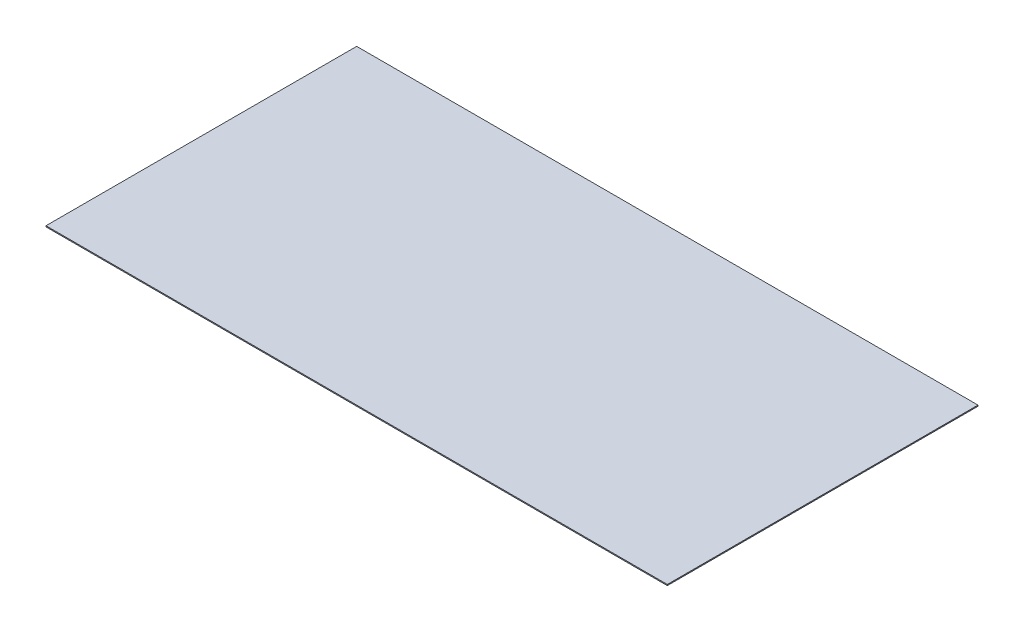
ISO-10303-21;
HEADER;
FILE_DESCRIPTION(('STEP AP214'),'2;1');
FILE_NAME('part.step','',(''),(''),'','','');
FILE_SCHEMA(('AUTOMOTIVE_DESIGN { 1 0 10303 214 1 1 1 1 }'));
ENDSEC;
DATA;
#1=APPLICATION_CONTEXT('core data for automotive mechanical design processes');
#2=APPLICATION_PROTOCOL_DEFINITION('international standard','automotive_design',2000,#1);
#3=PRODUCT_CONTEXT('',#1,'mechanical');
#4=PRODUCT('Part','Part','',(#3));
#5=PRODUCT_RELATED_PRODUCT_CATEGORY('part','',(#4));
#6=PRODUCT_DEFINITION_FORMATION('','',#4);
#7=PRODUCT_DEFINITION_CONTEXT('part definition',#1,'design');
#8=PRODUCT_DEFINITION('design','',#6,#7);
#9=PRODUCT_DEFINITION_SHAPE('','',#8);
#10=(LENGTH_UNIT() NAMED_UNIT(*) SI_UNIT(.MILLI.,.METRE.));
#11=(NAMED_UNIT(*) PLANE_ANGLE_UNIT() SI_UNIT($,.RADIAN.));
#12=(NAMED_UNIT(*) SI_UNIT($,.STERADIAN.) SOLID_ANGLE_UNIT());
#13=UNCERTAINTY_MEASURE_WITH_UNIT(LENGTH_MEASURE(1.E-05),#10,'distance_accuracy_value','');
#14=(GEOMETRIC_REPRESENTATION_CONTEXT(3) GLOBAL_UNCERTAINTY_ASSIGNED_CONTEXT((#13)) GLOBAL_UNIT_ASSIGNED_CONTEXT((#10,
#11,#12)) REPRESENTATION_CONTEXT('',''));
#15=CARTESIAN_POINT('',(0.,0.,0.));
#16=DIRECTION('',(0.,0.,1.));
#17=DIRECTION('',(1.,0.,0.));
#18=AXIS2_PLACEMENT_3D('',#15,#16,#17);
#19=CARTESIAN_POINT('',(0.,1.524,0.));
#20=DIRECTION('',(1.,0.,0.));
#21=DIRECTION('',(0.,0.,-1.));
#22=AXIS2_PLACEMENT_3D('',#19,#20,#21);
#23=PLANE('',#22);
#24=DIRECTION('',(0.,0.,1.));
#25=VECTOR('',#24,1.);
#26=CARTESIAN_POINT('',(0.,0.,0.));
#27=LINE('',#26,#25);
#28=CARTESIAN_POINT('',(0.,0.,-457.2));
#29=VERTEX_POINT('',#28);
#30=CARTESIAN_POINT('',(0.,0.,0.));
#31=VERTEX_POINT('',#30);
#32=EDGE_CURVE('E107',#29,#31,#27,.T.);
#33=ORIENTED_EDGE('',*,*,#32,.T.);
#34=DIRECTION('',(0.,-1.,0.));
#35=VECTOR('',#34,1.);
#36=CARTESIAN_POINT('',(0.,1.524,0.));
#37=LINE('',#36,#35);
#38=CARTESIAN_POINT('',(0.,1.524,0.));
#39=VERTEX_POINT('',#38);
#40=EDGE_CURVE('E11',#39,#31,#37,.T.);
#41=ORIENTED_EDGE('',*,*,#40,.F.);
#42=DIRECTION('',(0.,0.,1.));
#43=VECTOR('',#42,1.);
#44=CARTESIAN_POINT('',(0.,1.524,0.));
#45=LINE('',#44,#43);
#46=CARTESIAN_POINT('',(0.,1.524,-457.2));
#47=VERTEX_POINT('',#46);
#48=EDGE_CURVE('E91',#47,#39,#45,.T.);
#49=ORIENTED_EDGE('',*,*,#48,.F.);
#50=DIRECTION('',(0.,-1.,0.));
#51=VECTOR('',#50,1.);
#52=CARTESIAN_POINT('',(0.,1.524,-457.2));
#53=LINE('',#52,#51);
#54=EDGE_CURVE('E103',#47,#29,#53,.T.);
#55=ORIENTED_EDGE('',*,*,#54,.T.);
#56=EDGE_LOOP('',(#33,#41,#49,#55));
#57=FACE_BOUND('',#56,.T.);
#58=ADVANCED_FACE('F39',(#57),#23,.F.);
#59=CARTESIAN_POINT('',(0.,1.524,0.));
#60=DIRECTION('',(0.,0.,-1.));
#61=DIRECTION('',(-1.,0.,0.));
#62=AXIS2_PLACEMENT_3D('',#59,#60,#61);
#63=PLANE('',#62);
#64=DIRECTION('',(1.,0.,0.));
#65=VECTOR('',#64,1.);
#66=CARTESIAN_POINT('',(0.,0.,0.));
#67=LINE('',#66,#65);
#68=CARTESIAN_POINT('',(914.4,0.,0.));
#69=VERTEX_POINT('',#68);
#70=EDGE_CURVE('E96',#31,#69,#67,.T.);
#71=ORIENTED_EDGE('',*,*,#70,.T.);
#72=DIRECTION('',(0.,-1.,0.));
#73=VECTOR('',#72,1.);
#74=CARTESIAN_POINT('',(914.4,1.524,0.));
#75=LINE('',#74,#73);
#76=CARTESIAN_POINT('',(914.4,1.524,0.));
#77=VERTEX_POINT('',#76);
#78=EDGE_CURVE('E48',#77,#69,#75,.T.);
#79=ORIENTED_EDGE('',*,*,#78,.F.);
#80=DIRECTION('',(1.,0.,0.));
#81=VECTOR('',#80,1.);
#82=CARTESIAN_POINT('',(0.,1.524,0.));
#83=LINE('',#82,#81);
#84=EDGE_CURVE('E86',#39,#77,#83,.T.);
#85=ORIENTED_EDGE('',*,*,#84,.F.);
#86=ORIENTED_EDGE('',*,*,#40,.T.);
#87=EDGE_LOOP('',(#71,#79,#85,#86));
#88=FACE_BOUND('',#87,.T.);
#89=ADVANCED_FACE('F95',(#88),#63,.F.);
#90=CARTESIAN_POINT('',(914.4,1.524,0.));
#91=DIRECTION('',(-1.,0.,0.));
#92=DIRECTION('',(0.,0.,1.));
#93=AXIS2_PLACEMENT_3D('',#90,#91,#92);
#94=PLANE('',#93);
#95=DIRECTION('',(0.,0.,-1.));
#96=VECTOR('',#95,1.);
#97=CARTESIAN_POINT('',(914.4,0.,0.));
#98=LINE('',#97,#96);
#99=CARTESIAN_POINT('',(914.4,0.,-457.2));
#100=VERTEX_POINT('',#99);
#101=EDGE_CURVE('E73',#69,#100,#98,.T.);
#102=ORIENTED_EDGE('',*,*,#101,.T.);
#103=DIRECTION('',(0.,-1.,0.));
#104=VECTOR('',#103,1.);
#105=CARTESIAN_POINT('',(914.4,1.524,-457.2));
#106=LINE('',#105,#104);
#107=CARTESIAN_POINT('',(914.4,1.524,-457.2));
#108=VERTEX_POINT('',#107);
#109=EDGE_CURVE('E98',#108,#100,#106,.T.);
#110=ORIENTED_EDGE('',*,*,#109,.F.);
#111=DIRECTION('',(0.,0.,-1.));
#112=VECTOR('',#111,1.);
#113=CARTESIAN_POINT('',(914.4,1.524,0.));
#114=LINE('',#113,#112);
#115=EDGE_CURVE('E89',#77,#108,#114,.T.);
#116=ORIENTED_EDGE('',*,*,#115,.F.);
#117=ORIENTED_EDGE('',*,*,#78,.T.);
#118=EDGE_LOOP('',(#102,#110,#116,#117));
#119=FACE_BOUND('',#118,.T.);
#120=ADVANCED_FACE('F99',(#119),#94,.F.);
#121=CARTESIAN_POINT('',(0.,1.524,-457.2));
#122=DIRECTION('',(0.,0.,1.));
#123=DIRECTION('',(1.,0.,0.));
#124=AXIS2_PLACEMENT_3D('',#121,#122,#123);
#125=PLANE('',#124);
#126=DIRECTION('',(-1.,0.,0.));
#127=VECTOR('',#126,1.);
#128=CARTESIAN_POINT('',(0.,0.,-457.2));
#129=LINE('',#128,#127);
#130=EDGE_CURVE('E79',#100,#29,#129,.T.);
#131=ORIENTED_EDGE('',*,*,#130,.T.);
#132=ORIENTED_EDGE('',*,*,#54,.F.);
#133=DIRECTION('',(-1.,0.,0.));
#134=VECTOR('',#133,1.);
#135=CARTESIAN_POINT('',(0.,1.524,-457.2));
#136=LINE('',#135,#134);
#137=EDGE_CURVE('E56',#108,#47,#136,.T.);
#138=ORIENTED_EDGE('',*,*,#137,.F.);
#139=ORIENTED_EDGE('',*,*,#109,.T.);
#140=EDGE_LOOP('',(#131,#132,#138,#139));
#141=FACE_BOUND('',#140,.T.);
#142=ADVANCED_FACE('F120',(#141),#125,.F.);
#143=CARTESIAN_POINT('',(0.,1.524,0.));
#144=DIRECTION('',(0.,-1.,0.));
#145=DIRECTION('',(0.,0.,-1.));
#146=AXIS2_PLACEMENT_3D('',#143,#144,#145);
#147=PLANE('',#146);
#148=ORIENTED_EDGE('',*,*,#48,.T.);
#149=ORIENTED_EDGE('',*,*,#84,.T.);
#150=ORIENTED_EDGE('',*,*,#115,.T.);
#151=ORIENTED_EDGE('',*,*,#137,.T.);
#152=EDGE_LOOP('',(#148,#149,#150,#151));
#153=FACE_BOUND('',#152,.T.);
#154=ADVANCED_FACE('F87',(#153),#147,.F.);
#155=CARTESIAN_POINT('',(0.,0.,0.));
#156=DIRECTION('',(0.,-1.,0.));
#157=DIRECTION('',(0.,0.,-1.));
#158=AXIS2_PLACEMENT_3D('',#155,#156,#157);
#159=PLANE('',#158);
#160=ORIENTED_EDGE('',*,*,#32,.F.);
#161=ORIENTED_EDGE('',*,*,#130,.F.);
#162=ORIENTED_EDGE('',*,*,#101,.F.);
#163=ORIENTED_EDGE('',*,*,#70,.F.);
#164=EDGE_LOOP('',(#160,#161,#162,#163));
#165=FACE_BOUND('',#164,.T.);
#166=ADVANCED_FACE('F123',(#165),#159,.T.);
#167=CLOSED_SHELL('',(#58,#89,#120,#142,#154,#166));
#168=MANIFOLD_SOLID_BREP('B2',#167);
#169=ADVANCED_BREP_SHAPE_REPRESENTATION('',(#18,#168),#14);
#170=SHAPE_DEFINITION_REPRESENTATION(#9,#169);
ENDSEC;
END-ISO-10303-21;
